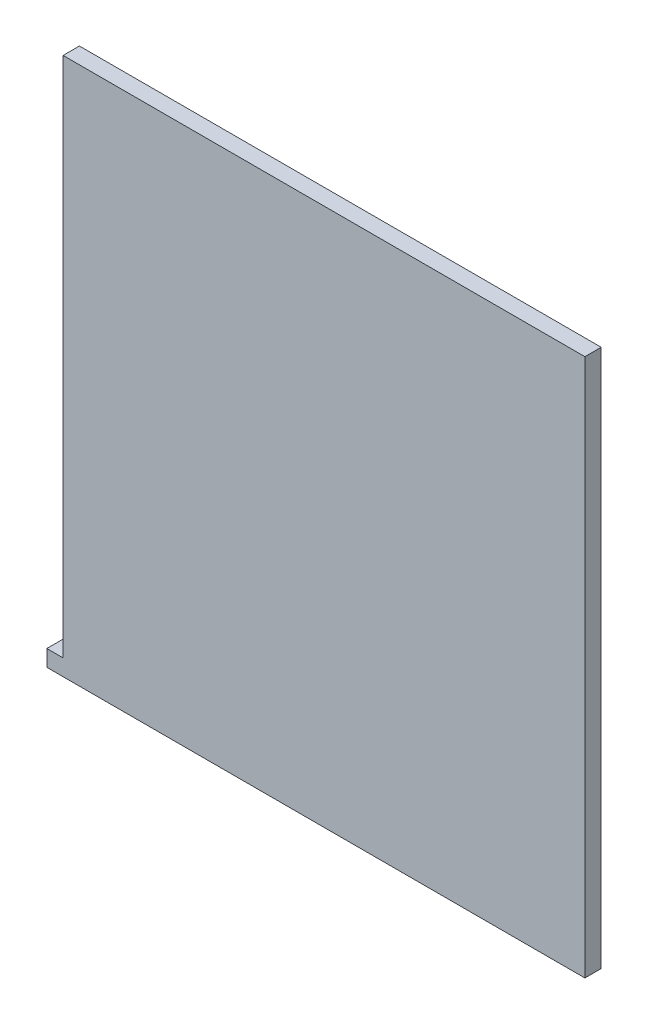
from build123d import *

# Parameters (mm, degrees)
EXTRUDE1_DEPTH = 12.7


with BuildPart() as part:
    # Sketch1 → Extrude1 (new body)
    with BuildSketch(Plane.XY):
        Polygon((-215.9, -209.55), (-215.9, -196.85), (-203.2, -196.85), (-203.2, 209.55), (203.2, 209.55), (203.2, -196.85), (203.2, -209.55), align=None)
    extrude(amount=EXTRUDE1_DEPTH)


solid = part.part
